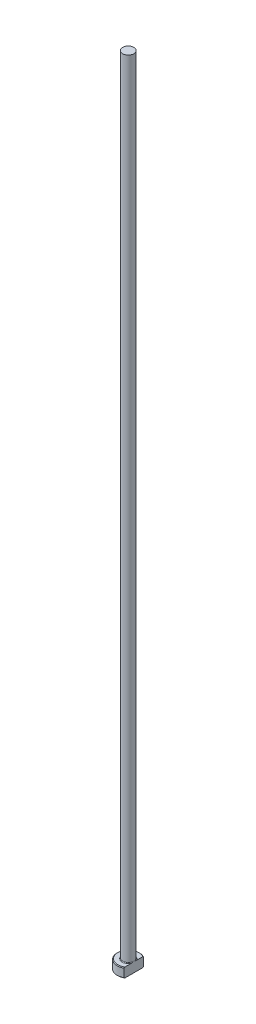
from build123d import *
from build123d.topology import SkipClean

# Parameters (mm, degrees)
CHAMFER1_SIZE = 0.2
FILLET1_R     = 0.2
KEY_DEPTH     = 251.048995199


with BuildPart() as part:
    # Sketch1 → Revolve1 (revolve)
    with BuildSketch(Plane.XY, mode=Mode.PRIVATE) as revolve1_sk:
        Polygon((0, 0), (-3.5, 0), (-3.5, 3), (-1.75, 3), (-1.75, 250), (0, 250), align=None)
    revolve(revolve1_sk.sketch.rotate(Axis((0, 259.958771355, 0), (0, -1, 0)), 270), axis=Axis((0, 259.958771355, 0), (0, -1, 0)))

    # Chamfer1
    chamfer1_edges = [part.edges().sort_by_distance(p)[0] for p in [
        (0, 3, -3.5),
        (0, 0, -3.5),
    ]]
    chamfer(chamfer1_edges, length=CHAMFER1_SIZE)

    # Fillet1
    fillet1_edges = [part.edges().sort_by_distance(p)[0] for p in [
        (0, 3, -1.75),
    ]]
    fillet(fillet1_edges, radius=FILLET1_R)

    # Sketch2 → KEY (cut, through all)
    with SkipClean():  # the faces are left unmerged after this step: merging them gives an invalid solid
        with BuildSketch(Plane(origin=(0, 0, 0), x_dir=(1, 0, 0), z_dir=(0, 1, 0))):
            with BuildLine():
                Line((1.75, 3.031088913), (1.75, -3.031088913))
                ThreePointArc((1.75, -3.031088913), (3.5, 0), (1.75, 3.031088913))
            make_face()
        extrude(amount=KEY_DEPTH, mode=Mode.SUBTRACT)


solid = part.part
